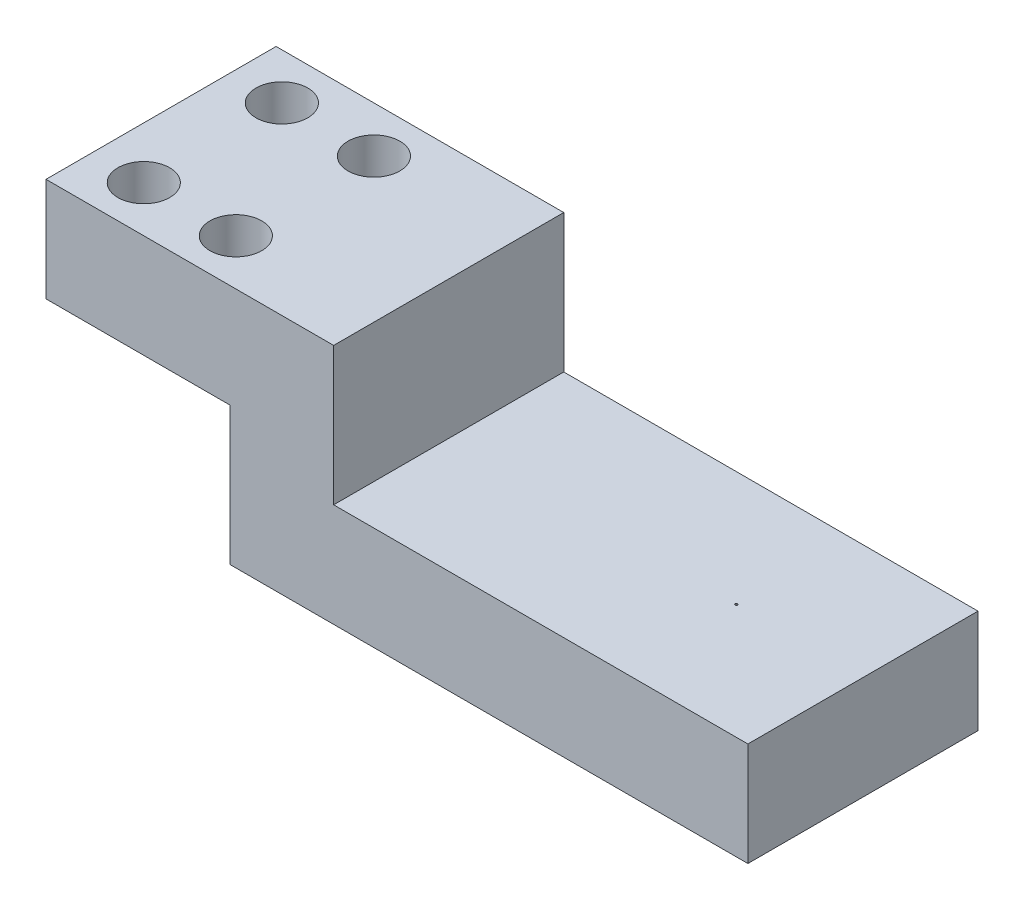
ISO-10303-21;
HEADER;
FILE_DESCRIPTION(('STEP AP214'),'2;1');
FILE_NAME('part.step','',(''),(''),'','','');
FILE_SCHEMA(('AUTOMOTIVE_DESIGN { 1 0 10303 214 1 1 1 1 }'));
ENDSEC;
DATA;
#1=APPLICATION_CONTEXT('core data for automotive mechanical design processes');
#2=APPLICATION_PROTOCOL_DEFINITION('international standard','automotive_design',2000,#1);
#3=PRODUCT_CONTEXT('',#1,'mechanical');
#4=PRODUCT('Part','Part','',(#3));
#5=PRODUCT_RELATED_PRODUCT_CATEGORY('part','',(#4));
#6=PRODUCT_DEFINITION_FORMATION('','',#4);
#7=PRODUCT_DEFINITION_CONTEXT('part definition',#1,'design');
#8=PRODUCT_DEFINITION('design','',#6,#7);
#9=PRODUCT_DEFINITION_SHAPE('','',#8);
#10=(LENGTH_UNIT() NAMED_UNIT(*) SI_UNIT(.MILLI.,.METRE.));
#11=(NAMED_UNIT(*) PLANE_ANGLE_UNIT() SI_UNIT($,.RADIAN.));
#12=(NAMED_UNIT(*) SI_UNIT($,.STERADIAN.) SOLID_ANGLE_UNIT());
#13=UNCERTAINTY_MEASURE_WITH_UNIT(LENGTH_MEASURE(1.E-05),#10,'distance_accuracy_value','');
#14=(GEOMETRIC_REPRESENTATION_CONTEXT(3) GLOBAL_UNCERTAINTY_ASSIGNED_CONTEXT((#13)) GLOBAL_UNIT_ASSIGNED_CONTEXT((#10,
#11,#12)) REPRESENTATION_CONTEXT('',''));
#15=CARTESIAN_POINT('',(0.,0.,0.));
#16=DIRECTION('',(0.,0.,1.));
#17=DIRECTION('',(1.,0.,0.));
#18=AXIS2_PLACEMENT_3D('',#15,#16,#17);
#19=CARTESIAN_POINT('',(0.,-9.,10.));
#20=DIRECTION('',(1.,0.,0.));
#21=DIRECTION('',(0.,0.,-1.));
#22=AXIS2_PLACEMENT_3D('',#19,#20,#21);
#23=PLANE('',#22);
#24=DIRECTION('',(0.,-1.,0.));
#25=VECTOR('',#24,1.);
#26=CARTESIAN_POINT('',(0.,-9.,-10.));
#27=LINE('',#26,#25);
#28=CARTESIAN_POINT('',(0.,0.,-10.));
#29=VERTEX_POINT('',#28);
#30=CARTESIAN_POINT('',(0.,-9.,-10.));
#31=VERTEX_POINT('',#30);
#32=EDGE_CURVE('E417',#29,#31,#27,.T.);
#33=ORIENTED_EDGE('',*,*,#32,.T.);
#34=DIRECTION('',(0.,0.,-1.));
#35=VECTOR('',#34,1.);
#36=CARTESIAN_POINT('',(0.,-9.,10.));
#37=LINE('',#36,#35);
#38=CARTESIAN_POINT('',(0.,-9.,10.));
#39=VERTEX_POINT('',#38);
#40=EDGE_CURVE('E11',#39,#31,#37,.T.);
#41=ORIENTED_EDGE('',*,*,#40,.F.);
#42=DIRECTION('',(0.,-1.,0.));
#43=VECTOR('',#42,1.);
#44=CARTESIAN_POINT('',(0.,-9.,10.));
#45=LINE('',#44,#43);
#46=CARTESIAN_POINT('',(0.,0.,10.));
#47=VERTEX_POINT('',#46);
#48=EDGE_CURVE('E449',#47,#39,#45,.T.);
#49=ORIENTED_EDGE('',*,*,#48,.F.);
#50=DIRECTION('',(0.,0.,-1.));
#51=VECTOR('',#50,1.);
#52=CARTESIAN_POINT('',(0.,0.,10.));
#53=LINE('',#52,#51);
#54=EDGE_CURVE('E430',#47,#29,#53,.T.);
#55=ORIENTED_EDGE('',*,*,#54,.T.);
#56=EDGE_LOOP('',(#33,#41,#49,#55));
#57=FACE_BOUND('',#56,.T.);
#58=ADVANCED_FACE('F349',(#57),#23,.F.);
#59=CARTESIAN_POINT('',(16.,-9.,10.));
#60=DIRECTION('',(0.,1.,0.));
#61=DIRECTION('',(0.,0.,1.));
#62=AXIS2_PLACEMENT_3D('',#59,#60,#61);
#63=PLANE('',#62);
#64=CARTESIAN_POINT('',(12.5,-9.,5.99999999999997));
#65=DIRECTION('',(0.,1.,0.));
#66=DIRECTION('',(0.,0.,1.));
#67=AXIS2_PLACEMENT_3D('',#64,#65,#66);
#68=CIRCLE('',#67,2.25);
#69=CARTESIAN_POINT('',(12.5,-9.,8.24999999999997));
#70=VERTEX_POINT('',#69);
#71=EDGE_CURVE('E549',#70,#70,#68,.T.);
#72=ORIENTED_EDGE('',*,*,#71,.T.);
#73=EDGE_LOOP('',(#72));
#74=FACE_BOUND('',#73,.T.);
#75=CARTESIAN_POINT('',(4.5,-9.,6.));
#76=DIRECTION('',(0.,1.,0.));
#77=DIRECTION('',(0.,0.,1.));
#78=AXIS2_PLACEMENT_3D('',#75,#76,#77);
#79=CIRCLE('',#78,2.25);
#80=CARTESIAN_POINT('',(4.5,-9.,8.25));
#81=VERTEX_POINT('',#80);
#82=EDGE_CURVE('E554',#81,#81,#79,.T.);
#83=ORIENTED_EDGE('',*,*,#82,.T.);
#84=EDGE_LOOP('',(#83));
#85=FACE_BOUND('',#84,.T.);
#86=CARTESIAN_POINT('',(12.5,-9.,-6.00000000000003));
#87=DIRECTION('',(0.,1.,0.));
#88=DIRECTION('',(0.,0.,1.));
#89=AXIS2_PLACEMENT_3D('',#86,#87,#88);
#90=CIRCLE('',#89,2.25);
#91=CARTESIAN_POINT('',(12.5,-9.,-3.75000000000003));
#92=VERTEX_POINT('',#91);
#93=EDGE_CURVE('E560',#92,#92,#90,.T.);
#94=ORIENTED_EDGE('',*,*,#93,.T.);
#95=EDGE_LOOP('',(#94));
#96=FACE_BOUND('',#95,.T.);
#97=CARTESIAN_POINT('',(4.5,-9.,-6.));
#98=DIRECTION('',(0.,1.,0.));
#99=DIRECTION('',(0.,0.,1.));
#100=AXIS2_PLACEMENT_3D('',#97,#98,#99);
#101=CIRCLE('',#100,2.25);
#102=CARTESIAN_POINT('',(4.5,-9.,-3.75));
#103=VERTEX_POINT('',#102);
#104=EDGE_CURVE('E431',#103,#103,#101,.T.);
#105=ORIENTED_EDGE('',*,*,#104,.T.);
#106=EDGE_LOOP('',(#105));
#107=FACE_BOUND('',#106,.T.);
#108=DIRECTION('',(1.,0.,0.));
#109=VECTOR('',#108,1.);
#110=CARTESIAN_POINT('',(16.,-9.,-10.));
#111=LINE('',#110,#109);
#112=CARTESIAN_POINT('',(16.,-9.,-10.));
#113=VERTEX_POINT('',#112);
#114=EDGE_CURVE('E413',#31,#113,#111,.T.);
#115=ORIENTED_EDGE('',*,*,#114,.T.);
#116=DIRECTION('',(0.,0.,-1.));
#117=VECTOR('',#116,1.);
#118=CARTESIAN_POINT('',(16.,-9.,10.));
#119=LINE('',#118,#117);
#120=CARTESIAN_POINT('',(16.,-9.,10.));
#121=VERTEX_POINT('',#120);
#122=EDGE_CURVE('E356',#121,#113,#119,.T.);
#123=ORIENTED_EDGE('',*,*,#122,.F.);
#124=DIRECTION('',(1.,0.,0.));
#125=VECTOR('',#124,1.);
#126=CARTESIAN_POINT('',(16.,-9.,10.));
#127=LINE('',#126,#125);
#128=EDGE_CURVE('E426',#39,#121,#127,.T.);
#129=ORIENTED_EDGE('',*,*,#128,.F.);
#130=ORIENTED_EDGE('',*,*,#40,.T.);
#131=EDGE_LOOP('',(#115,#123,#129,#130));
#132=FACE_BOUND('',#131,.T.);
#133=ADVANCED_FACE('F425',(#74,#85,#96,#107,#132),#63,.F.);
#134=CARTESIAN_POINT('',(16.,-21.,10.));
#135=DIRECTION('',(1.,0.,0.));
#136=DIRECTION('',(0.,0.,-1.));
#137=AXIS2_PLACEMENT_3D('',#134,#135,#136);
#138=PLANE('',#137);
#139=DIRECTION('',(0.,-1.,0.));
#140=VECTOR('',#139,1.);
#141=CARTESIAN_POINT('',(16.,-21.,-10.));
#142=LINE('',#141,#140);
#143=CARTESIAN_POINT('',(16.,-21.,-10.));
#144=VERTEX_POINT('',#143);
#145=EDGE_CURVE('E419',#113,#144,#142,.T.);
#146=ORIENTED_EDGE('',*,*,#145,.T.);
#147=DIRECTION('',(0.,0.,-1.));
#148=VECTOR('',#147,1.);
#149=CARTESIAN_POINT('',(16.,-21.,10.));
#150=LINE('',#149,#148);
#151=CARTESIAN_POINT('',(16.,-21.,10.));
#152=VERTEX_POINT('',#151);
#153=EDGE_CURVE('E475',#152,#144,#150,.T.);
#154=ORIENTED_EDGE('',*,*,#153,.F.);
#155=DIRECTION('',(0.,-1.,0.));
#156=VECTOR('',#155,1.);
#157=CARTESIAN_POINT('',(16.,-21.,10.));
#158=LINE('',#157,#156);
#159=EDGE_CURVE('E452',#121,#152,#158,.T.);
#160=ORIENTED_EDGE('',*,*,#159,.F.);
#161=ORIENTED_EDGE('',*,*,#122,.T.);
#162=EDGE_LOOP('',(#146,#154,#160,#161));
#163=FACE_BOUND('',#162,.T.);
#164=ADVANCED_FACE('F479',(#163),#138,.F.);
#165=CARTESIAN_POINT('',(61.,-21.,10.));
#166=DIRECTION('',(0.,1.,0.));
#167=DIRECTION('',(-1.,0.,0.));
#168=AXIS2_PLACEMENT_3D('',#165,#166,#167);
#169=PLANE('',#168);
#170=DIRECTION('',(1.,0.,0.));
#171=VECTOR('',#170,1.);
#172=CARTESIAN_POINT('',(61.,-21.,-10.));
#173=LINE('',#172,#171);
#174=CARTESIAN_POINT('',(61.,-21.,-10.));
#175=VERTEX_POINT('',#174);
#176=EDGE_CURVE('E439',#144,#175,#173,.T.);
#177=ORIENTED_EDGE('',*,*,#176,.T.);
#178=DIRECTION('',(0.,0.,-1.));
#179=VECTOR('',#178,1.);
#180=CARTESIAN_POINT('',(61.,-21.,10.));
#181=LINE('',#180,#179);
#182=CARTESIAN_POINT('',(61.,-21.,10.));
#183=VERTEX_POINT('',#182);
#184=EDGE_CURVE('E472',#183,#175,#181,.T.);
#185=ORIENTED_EDGE('',*,*,#184,.F.);
#186=DIRECTION('',(1.,0.,0.));
#187=VECTOR('',#186,1.);
#188=CARTESIAN_POINT('',(61.,-21.,10.));
#189=LINE('',#188,#187);
#190=EDGE_CURVE('E454',#152,#183,#189,.T.);
#191=ORIENTED_EDGE('',*,*,#190,.F.);
#192=ORIENTED_EDGE('',*,*,#153,.T.);
#193=EDGE_LOOP('',(#177,#185,#191,#192));
#194=FACE_BOUND('',#193,.T.);
#195=ADVANCED_FACE('F487',(#194),#169,.F.);
#196=CARTESIAN_POINT('',(61.,-12.,10.));
#197=DIRECTION('',(-1.,0.,0.));
#198=DIRECTION('',(0.,0.,1.));
#199=AXIS2_PLACEMENT_3D('',#196,#197,#198);
#200=PLANE('',#199);
#201=DIRECTION('',(0.,1.,0.));
#202=VECTOR('',#201,1.);
#203=CARTESIAN_POINT('',(61.,-12.,-10.));
#204=LINE('',#203,#202);
#205=CARTESIAN_POINT('',(61.,-12.,-10.));
#206=VERTEX_POINT('',#205);
#207=EDGE_CURVE('E441',#175,#206,#204,.T.);
#208=ORIENTED_EDGE('',*,*,#207,.T.);
#209=DIRECTION('',(0.,0.,-1.));
#210=VECTOR('',#209,1.);
#211=CARTESIAN_POINT('',(61.,-12.,10.));
#212=LINE('',#211,#210);
#213=CARTESIAN_POINT('',(61.,-12.,10.));
#214=VERTEX_POINT('',#213);
#215=EDGE_CURVE('E469',#214,#206,#212,.T.);
#216=ORIENTED_EDGE('',*,*,#215,.F.);
#217=DIRECTION('',(0.,1.,0.));
#218=VECTOR('',#217,1.);
#219=CARTESIAN_POINT('',(61.,-12.,10.));
#220=LINE('',#219,#218);
#221=EDGE_CURVE('E456',#183,#214,#220,.T.);
#222=ORIENTED_EDGE('',*,*,#221,.F.);
#223=ORIENTED_EDGE('',*,*,#184,.T.);
#224=EDGE_LOOP('',(#208,#216,#222,#223));
#225=FACE_BOUND('',#224,.T.);
#226=ADVANCED_FACE('F490',(#225),#200,.F.);
#227=CARTESIAN_POINT('',(25.,-12.,10.));
#228=DIRECTION('',(0.,-1.,0.));
#229=DIRECTION('',(1.,0.,0.));
#230=AXIS2_PLACEMENT_3D('',#227,#228,#229);
#231=PLANE('',#230);
#232=CARTESIAN_POINT('',(50.,-12.,0.));
#233=DIRECTION('',(0.,1.,0.));
#234=DIRECTION('',(-1.,0.,0.));
#235=AXIS2_PLACEMENT_3D('',#232,#233,#234);
#236=CIRCLE('',#235,0.103308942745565);
#237=CARTESIAN_POINT('',(49.8966910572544,-12.,0.));
#238=VERTEX_POINT('',#237);
#239=EDGE_CURVE('E538',#238,#238,#236,.T.);
#240=ORIENTED_EDGE('',*,*,#239,.F.);
#241=EDGE_LOOP('',(#240));
#242=FACE_BOUND('',#241,.T.);
#243=DIRECTION('',(-1.,0.,0.));
#244=VECTOR('',#243,1.);
#245=CARTESIAN_POINT('',(25.,-12.,-10.));
#246=LINE('',#245,#244);
#247=CARTESIAN_POINT('',(25.,-12.,-10.));
#248=VERTEX_POINT('',#247);
#249=EDGE_CURVE('E443',#206,#248,#246,.T.);
#250=ORIENTED_EDGE('',*,*,#249,.T.);
#251=DIRECTION('',(0.,0.,-1.));
#252=VECTOR('',#251,1.);
#253=CARTESIAN_POINT('',(25.,-12.,10.));
#254=LINE('',#253,#252);
#255=CARTESIAN_POINT('',(25.,-12.,10.));
#256=VERTEX_POINT('',#255);
#257=EDGE_CURVE('E466',#256,#248,#254,.T.);
#258=ORIENTED_EDGE('',*,*,#257,.F.);
#259=DIRECTION('',(-1.,0.,0.));
#260=VECTOR('',#259,1.);
#261=CARTESIAN_POINT('',(25.,-12.,10.));
#262=LINE('',#261,#260);
#263=EDGE_CURVE('E458',#214,#256,#262,.T.);
#264=ORIENTED_EDGE('',*,*,#263,.F.);
#265=ORIENTED_EDGE('',*,*,#215,.T.);
#266=EDGE_LOOP('',(#250,#258,#264,#265));
#267=FACE_BOUND('',#266,.T.);
#268=ADVANCED_FACE('F495',(#242,#267),#231,.F.);
#269=CARTESIAN_POINT('',(25.,0.,10.));
#270=DIRECTION('',(-1.,0.,0.));
#271=DIRECTION('',(0.,0.,1.));
#272=AXIS2_PLACEMENT_3D('',#269,#270,#271);
#273=PLANE('',#272);
#274=DIRECTION('',(0.,1.,0.));
#275=VECTOR('',#274,1.);
#276=CARTESIAN_POINT('',(25.,0.,-10.));
#277=LINE('',#276,#275);
#278=CARTESIAN_POINT('',(25.,0.,-10.));
#279=VERTEX_POINT('',#278);
#280=EDGE_CURVE('E445',#248,#279,#277,.T.);
#281=ORIENTED_EDGE('',*,*,#280,.T.);
#282=DIRECTION('',(0.,0.,-1.));
#283=VECTOR('',#282,1.);
#284=CARTESIAN_POINT('',(25.,0.,10.));
#285=LINE('',#284,#283);
#286=CARTESIAN_POINT('',(25.,0.,10.));
#287=VERTEX_POINT('',#286);
#288=EDGE_CURVE('E463',#287,#279,#285,.T.);
#289=ORIENTED_EDGE('',*,*,#288,.F.);
#290=DIRECTION('',(0.,1.,0.));
#291=VECTOR('',#290,1.);
#292=CARTESIAN_POINT('',(25.,0.,10.));
#293=LINE('',#292,#291);
#294=EDGE_CURVE('E368',#256,#287,#293,.T.);
#295=ORIENTED_EDGE('',*,*,#294,.F.);
#296=ORIENTED_EDGE('',*,*,#257,.T.);
#297=EDGE_LOOP('',(#281,#289,#295,#296));
#298=FACE_BOUND('',#297,.T.);
#299=ADVANCED_FACE('F498',(#298),#273,.F.);
#300=CARTESIAN_POINT('',(0.,0.,10.));
#301=DIRECTION('',(0.,-1.,0.));
#302=DIRECTION('',(0.,0.,-1.));
#303=AXIS2_PLACEMENT_3D('',#300,#301,#302);
#304=PLANE('',#303);
#305=CARTESIAN_POINT('',(12.5,0.,5.99999999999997));
#306=DIRECTION('',(0.,1.,0.));
#307=DIRECTION('',(0.,0.,1.));
#308=AXIS2_PLACEMENT_3D('',#305,#306,#307);
#309=CIRCLE('',#308,2.25);
#310=CARTESIAN_POINT('',(12.5,0.,8.24999999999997));
#311=VERTEX_POINT('',#310);
#312=EDGE_CURVE('E544',#311,#311,#309,.T.);
#313=ORIENTED_EDGE('',*,*,#312,.F.);
#314=EDGE_LOOP('',(#313));
#315=FACE_BOUND('',#314,.T.);
#316=CARTESIAN_POINT('',(4.5,0.,6.));
#317=DIRECTION('',(0.,1.,0.));
#318=DIRECTION('',(0.,0.,1.));
#319=AXIS2_PLACEMENT_3D('',#316,#317,#318);
#320=CIRCLE('',#319,2.25);
#321=CARTESIAN_POINT('',(4.5,0.,8.25));
#322=VERTEX_POINT('',#321);
#323=EDGE_CURVE('E551',#322,#322,#320,.T.);
#324=ORIENTED_EDGE('',*,*,#323,.F.);
#325=EDGE_LOOP('',(#324));
#326=FACE_BOUND('',#325,.T.);
#327=CARTESIAN_POINT('',(12.5,0.,-6.00000000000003));
#328=DIRECTION('',(0.,1.,0.));
#329=DIRECTION('',(0.,0.,1.));
#330=AXIS2_PLACEMENT_3D('',#327,#328,#329);
#331=CIRCLE('',#330,2.25);
#332=CARTESIAN_POINT('',(12.5,0.,-3.75000000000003));
#333=VERTEX_POINT('',#332);
#334=EDGE_CURVE('E557',#333,#333,#331,.T.);
#335=ORIENTED_EDGE('',*,*,#334,.F.);
#336=EDGE_LOOP('',(#335));
#337=FACE_BOUND('',#336,.T.);
#338=CARTESIAN_POINT('',(4.5,0.,-6.));
#339=DIRECTION('',(0.,1.,0.));
#340=DIRECTION('',(0.,0.,1.));
#341=AXIS2_PLACEMENT_3D('',#338,#339,#340);
#342=CIRCLE('',#341,2.25);
#343=CARTESIAN_POINT('',(4.5,0.,-3.75));
#344=VERTEX_POINT('',#343);
#345=EDGE_CURVE('E434',#344,#344,#342,.T.);
#346=ORIENTED_EDGE('',*,*,#345,.F.);
#347=EDGE_LOOP('',(#346));
#348=FACE_BOUND('',#347,.T.);
#349=DIRECTION('',(-1.,0.,0.));
#350=VECTOR('',#349,1.);
#351=CARTESIAN_POINT('',(0.,0.,-10.));
#352=LINE('',#351,#350);
#353=EDGE_CURVE('E447',#279,#29,#352,.T.);
#354=ORIENTED_EDGE('',*,*,#353,.T.);
#355=ORIENTED_EDGE('',*,*,#54,.F.);
#356=DIRECTION('',(-1.,0.,0.));
#357=VECTOR('',#356,1.);
#358=CARTESIAN_POINT('',(0.,0.,10.));
#359=LINE('',#358,#357);
#360=EDGE_CURVE('E363',#287,#47,#359,.T.);
#361=ORIENTED_EDGE('',*,*,#360,.F.);
#362=ORIENTED_EDGE('',*,*,#288,.T.);
#363=EDGE_LOOP('',(#354,#355,#361,#362));
#364=FACE_BOUND('',#363,.T.);
#365=ADVANCED_FACE('F500',(#315,#326,#337,#348,#364),#304,.F.);
#366=CARTESIAN_POINT('',(0.,0.,10.));
#367=DIRECTION('',(0.,0.,-1.));
#368=DIRECTION('',(-1.,0.,0.));
#369=AXIS2_PLACEMENT_3D('',#366,#367,#368);
#370=PLANE('',#369);
#371=ORIENTED_EDGE('',*,*,#48,.T.);
#372=ORIENTED_EDGE('',*,*,#128,.T.);
#373=ORIENTED_EDGE('',*,*,#159,.T.);
#374=ORIENTED_EDGE('',*,*,#190,.T.);
#375=ORIENTED_EDGE('',*,*,#221,.T.);
#376=ORIENTED_EDGE('',*,*,#263,.T.);
#377=ORIENTED_EDGE('',*,*,#294,.T.);
#378=ORIENTED_EDGE('',*,*,#360,.T.);
#379=EDGE_LOOP('',(#371,#372,#373,#374,#375,#376,#377,#378));
#380=FACE_BOUND('',#379,.T.);
#381=ADVANCED_FACE('F482',(#380),#370,.F.);
#382=CARTESIAN_POINT('',(0.,0.,-10.));
#383=DIRECTION('',(0.,0.,-1.));
#384=DIRECTION('',(-1.,0.,0.));
#385=AXIS2_PLACEMENT_3D('',#382,#383,#384);
#386=PLANE('',#385);
#387=ORIENTED_EDGE('',*,*,#32,.F.);
#388=ORIENTED_EDGE('',*,*,#353,.F.);
#389=ORIENTED_EDGE('',*,*,#280,.F.);
#390=ORIENTED_EDGE('',*,*,#249,.F.);
#391=ORIENTED_EDGE('',*,*,#207,.F.);
#392=ORIENTED_EDGE('',*,*,#176,.F.);
#393=ORIENTED_EDGE('',*,*,#145,.F.);
#394=ORIENTED_EDGE('',*,*,#114,.F.);
#395=EDGE_LOOP('',(#387,#388,#389,#390,#391,#392,#393,#394));
#396=FACE_BOUND('',#395,.T.);
#397=ADVANCED_FACE('F414',(#396),#386,.T.);
#398=CARTESIAN_POINT('',(4.5,-21.,-6.));
#399=DIRECTION('',(0.,1.,0.));
#400=DIRECTION('',(0.,0.,1.));
#401=AXIS2_PLACEMENT_3D('',#398,#399,#400);
#402=CYLINDRICAL_SURFACE('',#401,2.25);
#403=ORIENTED_EDGE('',*,*,#345,.T.);
#404=EDGE_LOOP('',(#403));
#405=FACE_BOUND('',#404,.T.);
#406=ORIENTED_EDGE('',*,*,#104,.F.);
#407=EDGE_LOOP('',(#406));
#408=FACE_BOUND('',#407,.T.);
#409=ADVANCED_FACE('F565',(#405,#408),#402,.F.);
#410=CARTESIAN_POINT('',(12.5,-21.,-6.00000000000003));
#411=DIRECTION('',(0.,1.,0.));
#412=DIRECTION('',(0.,0.,1.));
#413=AXIS2_PLACEMENT_3D('',#410,#411,#412);
#414=CYLINDRICAL_SURFACE('',#413,2.25);
#415=ORIENTED_EDGE('',*,*,#334,.T.);
#416=EDGE_LOOP('',(#415));
#417=FACE_BOUND('',#416,.T.);
#418=ORIENTED_EDGE('',*,*,#93,.F.);
#419=EDGE_LOOP('',(#418));
#420=FACE_BOUND('',#419,.T.);
#421=ADVANCED_FACE('F568',(#417,#420),#414,.F.);
#422=CARTESIAN_POINT('',(4.5,-21.,6.));
#423=DIRECTION('',(0.,1.,0.));
#424=DIRECTION('',(0.,0.,1.));
#425=AXIS2_PLACEMENT_3D('',#422,#423,#424);
#426=CYLINDRICAL_SURFACE('',#425,2.25);
#427=ORIENTED_EDGE('',*,*,#323,.T.);
#428=EDGE_LOOP('',(#427));
#429=FACE_BOUND('',#428,.T.);
#430=ORIENTED_EDGE('',*,*,#82,.F.);
#431=EDGE_LOOP('',(#430));
#432=FACE_BOUND('',#431,.T.);
#433=ADVANCED_FACE('F575',(#429,#432),#426,.F.);
#434=CARTESIAN_POINT('',(12.5,-21.,5.99999999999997));
#435=DIRECTION('',(0.,1.,0.));
#436=DIRECTION('',(0.,0.,1.));
#437=AXIS2_PLACEMENT_3D('',#434,#435,#436);
#438=CYLINDRICAL_SURFACE('',#437,2.25);
#439=ORIENTED_EDGE('',*,*,#312,.T.);
#440=EDGE_LOOP('',(#439));
#441=FACE_BOUND('',#440,.T.);
#442=ORIENTED_EDGE('',*,*,#71,.F.);
#443=EDGE_LOOP('',(#442));
#444=FACE_BOUND('',#443,.T.);
#445=ADVANCED_FACE('F582',(#441,#444),#438,.F.);
#446=CARTESIAN_POINT('',(50.,-12.1,0.));
#447=DIRECTION('',(0.,1.,0.));
#448=DIRECTION('',(-1.,0.,0.));
#449=AXIS2_PLACEMENT_3D('',#446,#447,#448);
#450=CYLINDRICAL_SURFACE('',#449,0.103308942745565);
#451=CARTESIAN_POINT('',(50.,-12.1,0.));
#452=DIRECTION('',(0.,1.,0.));
#453=DIRECTION('',(-1.,0.,0.));
#454=AXIS2_PLACEMENT_3D('',#451,#452,#453);
#455=CIRCLE('',#454,0.103308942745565);
#456=CARTESIAN_POINT('',(49.8966910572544,-12.1,0.));
#457=VERTEX_POINT('',#456);
#458=EDGE_CURVE('E541',#457,#457,#455,.T.);
#459=ORIENTED_EDGE('',*,*,#458,.F.);
#460=EDGE_LOOP('',(#459));
#461=FACE_BOUND('',#460,.T.);
#462=ORIENTED_EDGE('',*,*,#239,.T.);
#463=EDGE_LOOP('',(#462));
#464=FACE_BOUND('',#463,.T.);
#465=ADVANCED_FACE('F585',(#461,#464),#450,.F.);
#466=CARTESIAN_POINT('',(50.,-12.1,0.));
#467=DIRECTION('',(0.,1.,0.));
#468=DIRECTION('',(-1.,0.,0.));
#469=AXIS2_PLACEMENT_3D('',#466,#467,#468);
#470=PLANE('',#469);
#471=ORIENTED_EDGE('',*,*,#458,.T.);
#472=EDGE_LOOP('',(#471));
#473=FACE_BOUND('',#472,.T.);
#474=ADVANCED_FACE('F588',(#473),#470,.T.);
#475=CLOSED_SHELL('',(#58,#133,#164,#195,#226,#268,#299,#365,#381,#397,#409,#421,#433,#445,#465,#474));
#476=MANIFOLD_SOLID_BREP('B2',#475);
#477=ADVANCED_BREP_SHAPE_REPRESENTATION('',(#18,#476),#14);
#478=SHAPE_DEFINITION_REPRESENTATION(#9,#477);
ENDSEC;
END-ISO-10303-21;
